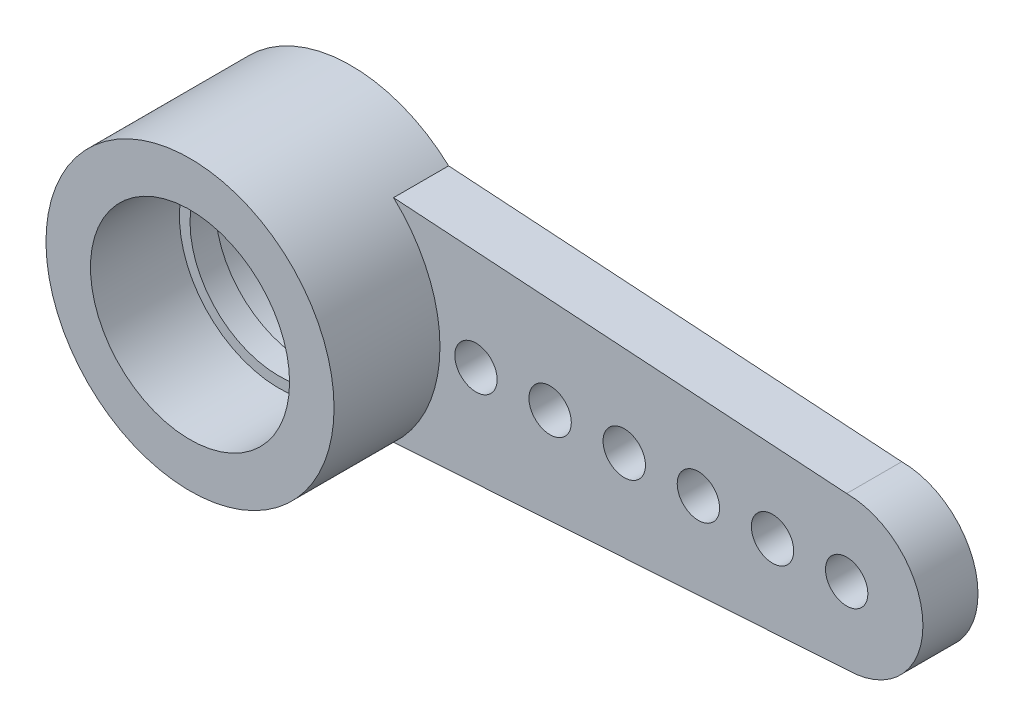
from build123d import *

# Parameters (mm, degrees)
BOSS_EXTRUDE1_DEPTH = 1.3
SKETCH2_R           = 2.35
CUT_EXTRUDE1_DEPTH  = 1.3
SKETCH3_R           = 3.4
SKETCH3_R_2         = 2.35
BOSS_EXTRUDE2_DEPTH = 2.5
BOSS_EXTRUDE3_START = -1.1
SKETCH4_R           = 2.35
SKETCH4_R_2         = 2.1
BOSS_EXTRUDE3_DEPTH = 0.6
CUT_EXTRUDE3_REACH  = 17.654
SKETCH5_R           = 0.5


with BuildPart() as part:
    # Sketch1 → Boss-Extrude1 (new body)
    with BuildSketch(Plane.XY):
        with BuildLine():
            Line((13, 1.8), (2.304343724, 2.5))
            ThreePointArc((2.304343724, 2.5), (-3.4, 0), (2.304343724, -2.5))
            Line((2.304343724, -2.5), (13, -1.8))
            ThreePointArc((13, -1.8), (14.8, 0), (13, 1.8))
        make_face()
    extrude(amount=BOSS_EXTRUDE1_DEPTH)

    # Sketch2 → Cut-Extrude1 (cut)
    with BuildSketch(Plane.XY.offset(1.3)):
        Circle(SKETCH2_R)
    extrude(amount=-CUT_EXTRUDE1_DEPTH, mode=Mode.SUBTRACT)

    # Sketch3 → Boss-Extrude2 (add)
    with BuildSketch(Plane.XY.offset(1.3)):
        with Locations(Location((0, 0, 0), (0, 0, 312.667925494))):
            Circle(SKETCH3_R)
        Circle(SKETCH3_R_2, mode=Mode.SUBTRACT)
    extrude(amount=BOSS_EXTRUDE2_DEPTH)

    # Sketch4 → Boss-Extrude3 (add)
    with BuildSketch(Plane(origin=(0, 0, 0), x_dir=(-1, 0, 0), z_dir=(0, 0, -1)).offset(BOSS_EXTRUDE3_START)):
        with Locations(Location((0, 0, 0), (0, 0, 180))):
            Circle(SKETCH4_R)
        Circle(SKETCH4_R_2, mode=Mode.SUBTRACT)
    extrude(amount=-BOSS_EXTRUDE3_DEPTH)

    # Sketch5 → Cut-Extrude3 (cut, up to next)
    with BuildSketch(Plane(origin=(0, 0, 0), x_dir=(-1, 0, 0), z_dir=(0, 0, -1)), mode=Mode.PRIVATE) as cut_extrude3_sk1:
        with Locations((-13, 0)):
            Circle(SKETCH5_R)
    cut_extrude3_tool1 = extrude(cut_extrude3_sk1.sketch, amount=-CUT_EXTRUDE3_REACH, mode=Mode.PRIVATE) & part.part
    # Sketch5 → Cut-Extrude3 (cut, up to next)
    with BuildSketch(Plane(origin=(0, 0, 0), x_dir=(-1, 0, 0), z_dir=(0, 0, -1)), mode=Mode.PRIVATE) as cut_extrude3_sk2:
        with Locations((-11.25, 0)):
            Circle(SKETCH5_R)
    cut_extrude3_tool2 = extrude(cut_extrude3_sk2.sketch, amount=-CUT_EXTRUDE3_REACH, mode=Mode.PRIVATE) & part.part
    # Sketch5 → Cut-Extrude3 (cut, up to next)
    with BuildSketch(Plane(origin=(0, 0, 0), x_dir=(-1, 0, 0), z_dir=(0, 0, -1)), mode=Mode.PRIVATE) as cut_extrude3_sk3:
        with Locations((-9.5, 0)):
            Circle(SKETCH5_R)
    cut_extrude3_tool3 = extrude(cut_extrude3_sk3.sketch, amount=-CUT_EXTRUDE3_REACH, mode=Mode.PRIVATE) & part.part
    # Sketch5 → Cut-Extrude3 (cut, up to next)
    with BuildSketch(Plane(origin=(0, 0, 0), x_dir=(-1, 0, 0), z_dir=(0, 0, -1)), mode=Mode.PRIVATE) as cut_extrude3_sk4:
        with Locations((-7.75, 0)):
            Circle(SKETCH5_R)
    cut_extrude3_tool4 = extrude(cut_extrude3_sk4.sketch, amount=-CUT_EXTRUDE3_REACH, mode=Mode.PRIVATE) & part.part
    # Sketch5 → Cut-Extrude3 (cut, up to next)
    with BuildSketch(Plane(origin=(0, 0, 0), x_dir=(-1, 0, 0), z_dir=(0, 0, -1)), mode=Mode.PRIVATE) as cut_extrude3_sk5:
        with Locations((-6, 0)):
            Circle(SKETCH5_R)
    cut_extrude3_tool5 = extrude(cut_extrude3_sk5.sketch, amount=-CUT_EXTRUDE3_REACH, mode=Mode.PRIVATE) & part.part
    # Sketch5 → Cut-Extrude3 (cut, up to next)
    with BuildSketch(Plane(origin=(0, 0, 0), x_dir=(-1, 0, 0), z_dir=(0, 0, -1)), mode=Mode.PRIVATE) as cut_extrude3_sk6:
        with Locations((-4.25, 0)):
            Circle(SKETCH5_R)
    cut_extrude3_tool6 = extrude(cut_extrude3_sk6.sketch, amount=-CUT_EXTRUDE3_REACH, mode=Mode.PRIVATE) & part.part
    add(cut_extrude3_tool1.solids().sort_by_distance((13, 0, 0))[0], mode=Mode.SUBTRACT)
    add(cut_extrude3_tool2.solids().sort_by_distance((11.25, 0, 0))[0], mode=Mode.SUBTRACT)
    add(cut_extrude3_tool3.solids().sort_by_distance((9.5, 0, 0))[0], mode=Mode.SUBTRACT)
    add(cut_extrude3_tool4.solids().sort_by_distance((7.75, 0, 0))[0], mode=Mode.SUBTRACT)
    add(cut_extrude3_tool5.solids().sort_by_distance((6, 0, 0))[0], mode=Mode.SUBTRACT)
    add(cut_extrude3_tool6.solids().sort_by_distance((4.25, 0, 0))[0], mode=Mode.SUBTRACT)


solid = part.part
